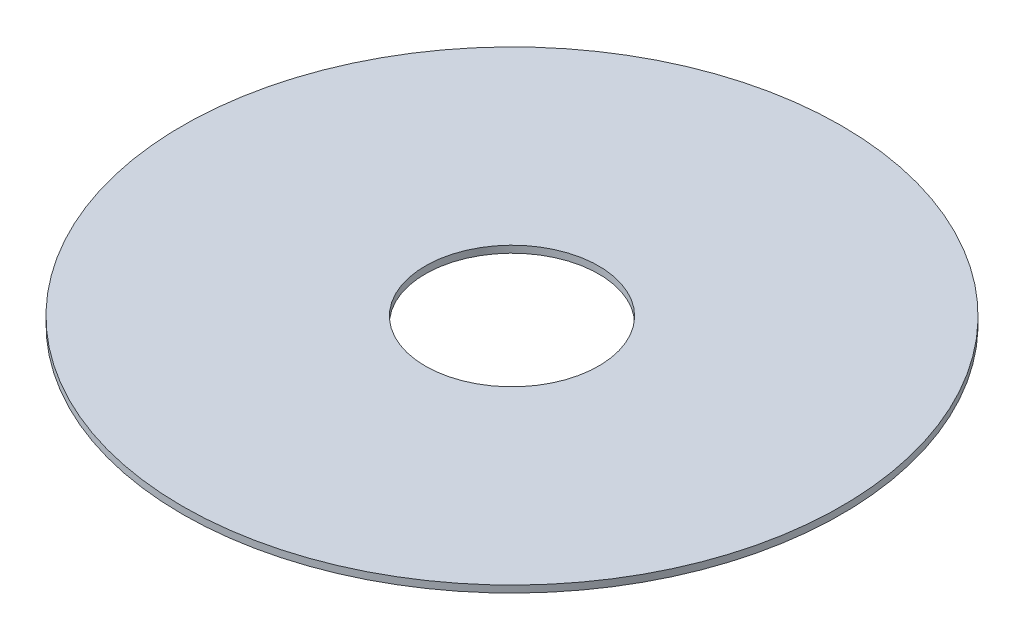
ISO-10303-21;
HEADER;
FILE_DESCRIPTION(('STEP AP214'),'2;1');
FILE_NAME('part.step','',(''),(''),'','','');
FILE_SCHEMA(('AUTOMOTIVE_DESIGN { 1 0 10303 214 1 1 1 1 }'));
ENDSEC;
DATA;
#1=APPLICATION_CONTEXT('core data for automotive mechanical design processes');
#2=APPLICATION_PROTOCOL_DEFINITION('international standard','automotive_design',2000,#1);
#3=PRODUCT_CONTEXT('',#1,'mechanical');
#4=PRODUCT('Part','Part','',(#3));
#5=PRODUCT_RELATED_PRODUCT_CATEGORY('part','',(#4));
#6=PRODUCT_DEFINITION_FORMATION('','',#4);
#7=PRODUCT_DEFINITION_CONTEXT('part definition',#1,'design');
#8=PRODUCT_DEFINITION('design','',#6,#7);
#9=PRODUCT_DEFINITION_SHAPE('','',#8);
#10=(LENGTH_UNIT() NAMED_UNIT(*) SI_UNIT(.MILLI.,.METRE.));
#11=(NAMED_UNIT(*) PLANE_ANGLE_UNIT() SI_UNIT($,.RADIAN.));
#12=(NAMED_UNIT(*) SI_UNIT($,.STERADIAN.) SOLID_ANGLE_UNIT());
#13=UNCERTAINTY_MEASURE_WITH_UNIT(LENGTH_MEASURE(1.E-05),#10,'distance_accuracy_value','');
#14=(GEOMETRIC_REPRESENTATION_CONTEXT(3) GLOBAL_UNCERTAINTY_ASSIGNED_CONTEXT((#13)) GLOBAL_UNIT_ASSIGNED_CONTEXT((#10,
#11,#12)) REPRESENTATION_CONTEXT('',''));
#15=CARTESIAN_POINT('',(0.,0.,0.));
#16=DIRECTION('',(0.,0.,1.));
#17=DIRECTION('',(1.,0.,0.));
#18=AXIS2_PLACEMENT_3D('',#15,#16,#17);
#19=CARTESIAN_POINT('',(0.,1.,0.));
#20=DIRECTION('',(0.,-1.,0.));
#21=DIRECTION('',(0.,0.,-1.));
#22=AXIS2_PLACEMENT_3D('',#19,#20,#21);
#23=CYLINDRICAL_SURFACE('',#22,47.5);
#24=CARTESIAN_POINT('',(0.,1.,0.));
#25=DIRECTION('',(0.,1.,0.));
#26=DIRECTION('',(0.,0.,1.));
#27=AXIS2_PLACEMENT_3D('',#24,#25,#26);
#28=CIRCLE('',#27,47.5);
#29=CARTESIAN_POINT('',(0.,1.,47.5));
#30=VERTEX_POINT('',#29);
#31=EDGE_CURVE('E10',#30,#30,#28,.T.);
#32=ORIENTED_EDGE('',*,*,#31,.F.);
#33=EDGE_LOOP('',(#32));
#34=FACE_BOUND('',#33,.T.);
#35=CARTESIAN_POINT('',(0.,0.,0.));
#36=DIRECTION('',(0.,1.,0.));
#37=DIRECTION('',(0.,0.,1.));
#38=AXIS2_PLACEMENT_3D('',#35,#36,#37);
#39=CIRCLE('',#38,47.5);
#40=CARTESIAN_POINT('',(0.,0.,47.5));
#41=VERTEX_POINT('',#40);
#42=EDGE_CURVE('E44',#41,#41,#39,.T.);
#43=ORIENTED_EDGE('',*,*,#42,.T.);
#44=EDGE_LOOP('',(#43));
#45=FACE_BOUND('',#44,.T.);
#46=ADVANCED_FACE('F41',(#34,#45),#23,.T.);
#47=CARTESIAN_POINT('',(0.,1.,0.));
#48=DIRECTION('',(0.,1.,0.));
#49=DIRECTION('',(0.,0.,1.));
#50=AXIS2_PLACEMENT_3D('',#47,#48,#49);
#51=PLANE('',#50);
#52=CARTESIAN_POINT('',(0.,1.,0.));
#53=DIRECTION('',(0.,1.,0.));
#54=DIRECTION('',(0.,0.,1.));
#55=AXIS2_PLACEMENT_3D('',#52,#53,#54);
#56=CIRCLE('',#55,12.5);
#57=CARTESIAN_POINT('',(0.,1.,12.5));
#58=VERTEX_POINT('',#57);
#59=EDGE_CURVE('E55',#58,#58,#56,.T.);
#60=ORIENTED_EDGE('',*,*,#59,.F.);
#61=EDGE_LOOP('',(#60));
#62=FACE_BOUND('',#61,.T.);
#63=ORIENTED_EDGE('',*,*,#31,.T.);
#64=EDGE_LOOP('',(#63));
#65=FACE_BOUND('',#64,.T.);
#66=ADVANCED_FACE('F72',(#62,#65),#51,.T.);
#67=CARTESIAN_POINT('',(0.,0.,0.));
#68=DIRECTION('',(0.,1.,0.));
#69=DIRECTION('',(0.,0.,1.));
#70=AXIS2_PLACEMENT_3D('',#67,#68,#69);
#71=PLANE('',#70);
#72=CARTESIAN_POINT('',(0.,0.,0.));
#73=DIRECTION('',(0.,1.,0.));
#74=DIRECTION('',(0.,0.,1.));
#75=AXIS2_PLACEMENT_3D('',#72,#73,#74);
#76=CIRCLE('',#75,12.5);
#77=CARTESIAN_POINT('',(0.,0.,12.5));
#78=VERTEX_POINT('',#77);
#79=EDGE_CURVE('E53',#78,#78,#76,.T.);
#80=ORIENTED_EDGE('',*,*,#79,.T.);
#81=EDGE_LOOP('',(#80));
#82=FACE_BOUND('',#81,.T.);
#83=ORIENTED_EDGE('',*,*,#42,.F.);
#84=EDGE_LOOP('',(#83));
#85=FACE_BOUND('',#84,.T.);
#86=ADVANCED_FACE('F63',(#82,#85),#71,.F.);
#87=CARTESIAN_POINT('',(0.,0.,0.));
#88=DIRECTION('',(0.,1.,0.));
#89=DIRECTION('',(0.,0.,1.));
#90=AXIS2_PLACEMENT_3D('',#87,#88,#89);
#91=CYLINDRICAL_SURFACE('',#90,12.5);
#92=ORIENTED_EDGE('',*,*,#79,.F.);
#93=EDGE_LOOP('',(#92));
#94=FACE_BOUND('',#93,.T.);
#95=ORIENTED_EDGE('',*,*,#59,.T.);
#96=EDGE_LOOP('',(#95));
#97=FACE_BOUND('',#96,.T.);
#98=ADVANCED_FACE('F66',(#94,#97),#91,.F.);
#99=CLOSED_SHELL('',(#46,#66,#86,#98));
#100=MANIFOLD_SOLID_BREP('B2',#99);
#101=ADVANCED_BREP_SHAPE_REPRESENTATION('',(#18,#100),#14);
#102=SHAPE_DEFINITION_REPRESENTATION(#9,#101);
ENDSEC;
END-ISO-10303-21;
